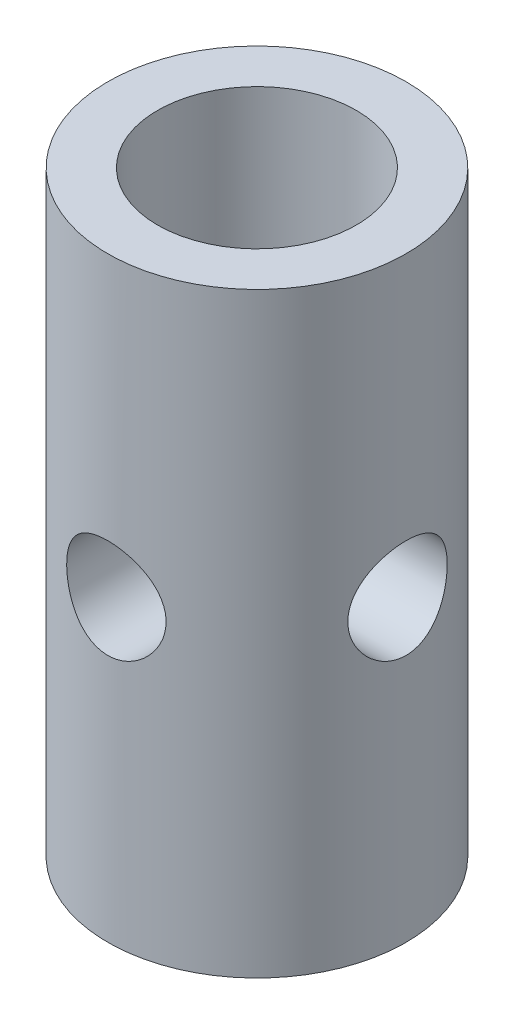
ISO-10303-21;
HEADER;
FILE_DESCRIPTION(('STEP AP214'),'2;1');
FILE_NAME('part.step','',(''),(''),'','','');
FILE_SCHEMA(('AUTOMOTIVE_DESIGN { 1 0 10303 214 1 1 1 1 }'));
ENDSEC;
DATA;
#1=APPLICATION_CONTEXT('core data for automotive mechanical design processes');
#2=APPLICATION_PROTOCOL_DEFINITION('international standard','automotive_design',2000,#1);
#3=PRODUCT_CONTEXT('',#1,'mechanical');
#4=PRODUCT('Part','Part','',(#3));
#5=PRODUCT_RELATED_PRODUCT_CATEGORY('part','',(#4));
#6=PRODUCT_DEFINITION_FORMATION('','',#4);
#7=PRODUCT_DEFINITION_CONTEXT('part definition',#1,'design');
#8=PRODUCT_DEFINITION('design','',#6,#7);
#9=PRODUCT_DEFINITION_SHAPE('','',#8);
#10=(LENGTH_UNIT() NAMED_UNIT(*) SI_UNIT(.MILLI.,.METRE.));
#11=(NAMED_UNIT(*) PLANE_ANGLE_UNIT() SI_UNIT($,.RADIAN.));
#12=(NAMED_UNIT(*) SI_UNIT($,.STERADIAN.) SOLID_ANGLE_UNIT());
#13=UNCERTAINTY_MEASURE_WITH_UNIT(LENGTH_MEASURE(1.E-05),#10,'distance_accuracy_value','');
#14=(GEOMETRIC_REPRESENTATION_CONTEXT(3) GLOBAL_UNCERTAINTY_ASSIGNED_CONTEXT((#13)) GLOBAL_UNIT_ASSIGNED_CONTEXT((#10,
#11,#12)) REPRESENTATION_CONTEXT('',''));
#15=CARTESIAN_POINT('',(0.,0.,0.));
#16=DIRECTION('',(0.,0.,1.));
#17=DIRECTION('',(1.,0.,0.));
#18=AXIS2_PLACEMENT_3D('',#15,#16,#17);
#19=CARTESIAN_POINT('',(0.,15.,-7.5));
#20=DIRECTION('',(0.,0.,1.));
#21=DIRECTION('',(1.,0.,0.));
#22=AXIS2_PLACEMENT_3D('',#19,#20,#21);
#23=CYLINDRICAL_SURFACE('',#22,2.5);
#24=CARTESIAN_POINT('',(2.5,15.,7.07106781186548));
#25=CARTESIAN_POINT('',(2.50000064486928,14.8638295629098,7.07106736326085));
#26=CARTESIAN_POINT('',(2.48883695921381,14.727663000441,7.07504423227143));
#27=CARTESIAN_POINT('',(2.44462782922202,14.4593639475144,7.09043935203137));
#28=CARTESIAN_POINT('',(2.41157878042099,14.3272321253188,7.10185882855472));
#29=CARTESIAN_POINT('',(2.32488871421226,14.0709327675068,7.13070509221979));
#30=CARTESIAN_POINT('',(2.27128805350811,13.9467501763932,7.14812009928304));
#31=CARTESIAN_POINT('',(2.14515407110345,13.7090998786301,7.18697805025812));
#32=CARTESIAN_POINT('',(2.07261657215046,13.5956345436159,7.20842188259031));
#33=CARTESIAN_POINT('',(1.90762786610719,13.3782000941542,7.25386223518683));
#34=CARTESIAN_POINT('',(1.8145608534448,13.2747114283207,7.2779223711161));
#35=CARTESIAN_POINT('',(1.61246916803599,13.0844829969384,7.32534662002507));
#36=CARTESIAN_POINT('',(1.50344193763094,12.9977459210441,7.34871062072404));
#37=CARTESIAN_POINT('',(1.26901126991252,12.841302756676,7.39284667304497));
#38=CARTESIAN_POINT('',(1.14325477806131,12.7721000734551,7.41353519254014));
#39=CARTESIAN_POINT('',(0.881078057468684,12.6560210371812,7.44923966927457));
#40=CARTESIAN_POINT('',(0.744660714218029,12.6091386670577,7.46425715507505));
#41=CARTESIAN_POINT('',(0.470072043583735,12.540660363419,7.48647688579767));
#42=CARTESIAN_POINT('',(0.332126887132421,12.5182413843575,7.49393286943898));
#43=CARTESIAN_POINT('',(0.0542446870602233,12.4967092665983,7.5010902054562));
#44=CARTESIAN_POINT('',(-0.0856918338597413,12.497590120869,7.50079355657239));
#45=CARTESIAN_POINT('',(-0.357758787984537,12.5221106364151,7.49265099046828));
#46=CARTESIAN_POINT('',(-0.489980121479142,12.5448563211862,7.48510161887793));
#47=CARTESIAN_POINT('',(-0.74860859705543,12.6109824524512,7.46367418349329));
#48=CARTESIAN_POINT('',(-0.87501534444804,12.6543642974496,7.44979569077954));
#49=CARTESIAN_POINT('',(-1.12038118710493,12.7610532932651,7.41689175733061));
#50=CARTESIAN_POINT('',(-1.23922055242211,12.8246148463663,7.39780106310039));
#51=CARTESIAN_POINT('',(-1.46481081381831,12.9696492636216,7.35645982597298));
#52=CARTESIAN_POINT('',(-1.57155833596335,13.0511271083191,7.33420840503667));
#53=CARTESIAN_POINT('',(-1.77525216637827,13.2341859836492,7.28765479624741));
#54=CARTESIAN_POINT('',(-1.87150039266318,13.3365328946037,7.26330537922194));
#55=CARTESIAN_POINT('',(-2.04569314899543,13.5561218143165,7.21618338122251));
#56=CARTESIAN_POINT('',(-2.12363485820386,13.6733661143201,7.19341104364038));
#57=CARTESIAN_POINT('',(-2.25996863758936,13.9216340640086,7.15176312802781));
#58=CARTESIAN_POINT('',(-2.31806615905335,14.0528303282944,7.1329477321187));
#59=CARTESIAN_POINT('',(-2.41110798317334,14.323928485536,7.10204127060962));
#60=CARTESIAN_POINT('',(-2.44606198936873,14.4638267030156,7.08994738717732));
#61=CARTESIAN_POINT('',(-2.4904032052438,14.7415958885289,7.07449090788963));
#62=CARTESIAN_POINT('',(-2.50087273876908,14.8792735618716,7.0707590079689));
#63=CARTESIAN_POINT('',(-2.4990135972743,15.1544403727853,7.07141680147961));
#64=CARTESIAN_POINT('',(-2.48668906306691,15.29192954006,7.07580501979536));
#65=CARTESIAN_POINT('',(-2.44056412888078,15.5578924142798,7.09184045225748));
#66=CARTESIAN_POINT('',(-2.40751598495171,15.6865135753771,7.10323313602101));
#67=CARTESIAN_POINT('',(-2.32178465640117,15.936359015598,7.13171384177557));
#68=CARTESIAN_POINT('',(-2.26909799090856,16.0575819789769,7.14880287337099));
#69=CARTESIAN_POINT('',(-2.14368585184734,16.2934510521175,7.18742193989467));
#70=CARTESIAN_POINT('',(-2.07037779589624,16.4077666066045,7.20907564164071));
#71=CARTESIAN_POINT('',(-1.90646407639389,16.6228651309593,7.25414421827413));
#72=CARTESIAN_POINT('',(-1.81585331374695,16.723644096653,7.27755961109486));
#73=CARTESIAN_POINT('',(-1.61472926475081,16.9138199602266,7.32487596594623));
#74=CARTESIAN_POINT('',(-1.50346817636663,17.0024359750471,7.34874608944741));
#75=CARTESIAN_POINT('',(-1.26706822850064,17.1597903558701,7.39317129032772));
#76=CARTESIAN_POINT('',(-1.14192986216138,17.2285294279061,7.41372648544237));
#77=CARTESIAN_POINT('',(-0.881949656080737,17.3435502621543,7.44911014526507));
#78=CARTESIAN_POINT('',(-0.74717780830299,17.3899781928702,7.46397575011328));
#79=CARTESIAN_POINT('',(-0.47114616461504,17.4593193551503,7.48646527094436));
#80=CARTESIAN_POINT('',(-0.329888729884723,17.4822410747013,7.49409180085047));
#81=CARTESIAN_POINT('',(-0.0520383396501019,17.5031551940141,7.50104658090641));
#82=CARTESIAN_POINT('',(0.0844618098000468,17.5022686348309,7.50074800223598));
#83=CARTESIAN_POINT('',(0.355277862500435,17.478356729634,7.49280491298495));
#84=CARTESIAN_POINT('',(0.489593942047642,17.4553331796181,7.48516099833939));
#85=CARTESIAN_POINT('',(0.750105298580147,17.3885444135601,7.46352287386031));
#86=CARTESIAN_POINT('',(0.876395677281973,17.3451144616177,7.44963145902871));
#87=CARTESIAN_POINT('',(1.11994587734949,17.2390561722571,7.41692901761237));
#88=CARTESIAN_POINT('',(1.23720406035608,17.1764243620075,7.39811710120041));
#89=CARTESIAN_POINT('',(1.46408504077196,17.031076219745,7.35664672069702));
#90=CARTESIAN_POINT('',(1.57326562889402,16.9477032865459,7.33387181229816));
#91=CARTESIAN_POINT('',(1.77645256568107,16.7643565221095,7.28732471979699));
#92=CARTESIAN_POINT('',(1.87045405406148,16.6643773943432,7.26355221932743));
#93=CARTESIAN_POINT('',(2.04435452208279,16.4459766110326,7.21658199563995));
#94=CARTESIAN_POINT('',(2.12355741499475,16.3269862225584,7.19344319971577));
#95=CARTESIAN_POINT('',(2.26078585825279,16.076663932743,7.15150483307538));
#96=CARTESIAN_POINT('',(2.31881694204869,15.9453352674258,7.13270412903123));
#97=CARTESIAN_POINT('',(2.40960957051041,15.6800954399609,7.10253335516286));
#98=CARTESIAN_POINT('',(2.4433947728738,15.5465693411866,7.09086582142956));
#99=CARTESIAN_POINT('',(2.48858580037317,15.2753598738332,7.07513458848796));
#100=CARTESIAN_POINT('',(2.49999934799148,15.1376779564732,7.07106826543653));
#101=CARTESIAN_POINT('',(2.5,15.,7.07106781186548));
#102=B_SPLINE_CURVE_WITH_KNOTS('',3,(#24,#25,#26,#27,#28,#29,#30,#31,#32,#33,#34,#35,#36,#37,
#38,#39,#40,#41,#42,#43,#44,#45,#46,#47,#48,#49,#50,#51,#52,#53,#54,#55,#56,#57,#58,#59,#60,#61,
#62,#63,#64,#65,#66,#67,#68,#69,#70,#71,#72,#73,#74,#75,#76,#77,#78,#79,#80,#81,#82,#83,#84,#85,
#86,#87,#88,#89,#90,#91,#92,#93,#94,#95,#96,#97,#98,#99,#100,#101),.UNSPECIFIED.,.T.,.F.,(4,2,2,
2,2,2,2,2,2,2,2,2,2,2,2,2,2,2,2,2,2,2,2,2,2,2,2,2,2,2,2,2,2,2,2,2,2,2,4),(0.,0.408001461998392,
0.816070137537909,1.22334156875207,1.63070291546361,2.0525334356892,2.4744316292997,
2.90733765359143,3.34012690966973,3.75785796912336,4.17548133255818,4.57672512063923,
4.97799610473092,5.38454137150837,5.79119979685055,6.21700435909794,6.64287449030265,
7.07481599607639,7.50657628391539,7.91885728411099,8.33106339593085,8.7291098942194,
9.12722697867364,9.53797144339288,9.94883714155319,10.3794702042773,10.8100879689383,
11.2378447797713,11.6654470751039,12.0729521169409,12.4804241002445,12.8814239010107,
13.2824962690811,13.6983879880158,14.1144126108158,14.5467225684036,14.9789194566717,
15.3915803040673,15.8040986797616),.UNSPECIFIED.);
#103=CARTESIAN_POINT('',(2.5,15.,7.07106781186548));
#104=VERTEX_POINT('',#103);
#105=EDGE_CURVE('E139',#104,#104,#102,.T.);
#106=ORIENTED_EDGE('',*,*,#105,.F.);
#107=EDGE_LOOP('',(#106));
#108=FACE_BOUND('',#107,.T.);
#109=CARTESIAN_POINT('',(0.,15.,0.));
#110=DIRECTION('',(0.707106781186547,0.,0.707106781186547));
#111=DIRECTION('',(-0.707106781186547,0.,0.707106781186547));
#112=AXIS2_PLACEMENT_3D('',#109,#110,#111);
#113=ELLIPSE('',#112,3.53553390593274,2.5);
#114=CARTESIAN_POINT('',(-1.76776695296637,13.2322330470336,1.76776695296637));
#115=VERTEX_POINT('',#114);
#116=CARTESIAN_POINT('',(-1.76776695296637,16.7677669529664,1.76776695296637));
#117=VERTEX_POINT('',#116);
#118=EDGE_CURVE('E76',#115,#117,#113,.F.);
#119=ORIENTED_EDGE('',*,*,#118,.T.);
#120=CARTESIAN_POINT('',(0.,15.,0.));
#121=DIRECTION('',(0.,-0.707106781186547,0.707106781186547));
#122=DIRECTION('',(0.,0.707106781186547,0.707106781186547));
#123=AXIS2_PLACEMENT_3D('',#120,#121,#122);
#124=ELLIPSE('',#123,3.53553390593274,2.5);
#125=CARTESIAN_POINT('',(1.76776695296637,16.7677669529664,1.76776695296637));
#126=VERTEX_POINT('',#125);
#127=EDGE_CURVE('E46',#117,#126,#124,.F.);
#128=ORIENTED_EDGE('',*,*,#127,.T.);
#129=CARTESIAN_POINT('',(0.,15.,0.));
#130=DIRECTION('',(-0.707106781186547,0.,0.707106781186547));
#131=DIRECTION('',(0.707106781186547,0.,0.707106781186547));
#132=AXIS2_PLACEMENT_3D('',#129,#130,#131);
#133=ELLIPSE('',#132,3.53553390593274,2.5);
#134=CARTESIAN_POINT('',(1.76776695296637,13.2322330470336,1.76776695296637));
#135=VERTEX_POINT('',#134);
#136=EDGE_CURVE('E89',#126,#135,#133,.F.);
#137=ORIENTED_EDGE('',*,*,#136,.T.);
#138=CARTESIAN_POINT('',(0.,15.,0.));
#139=DIRECTION('',(0.,0.707106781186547,0.707106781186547));
#140=DIRECTION('',(0.,-0.707106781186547,0.707106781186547));
#141=AXIS2_PLACEMENT_3D('',#138,#139,#140);
#142=ELLIPSE('',#141,3.53553390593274,2.5);
#143=EDGE_CURVE('E100',#135,#115,#142,.F.);
#144=ORIENTED_EDGE('',*,*,#143,.T.);
#145=EDGE_LOOP('',(#119,#128,#137,#144));
#146=FACE_BOUND('',#145,.T.);
#147=ADVANCED_FACE('F31',(#108,#146),#23,.F.);
#148=CARTESIAN_POINT('',(0.,30.,0.));
#149=DIRECTION('',(0.,-1.,0.));
#150=DIRECTION('',(0.,0.,-1.));
#151=AXIS2_PLACEMENT_3D('',#148,#149,#150);
#152=PLANE('',#151);
#153=CARTESIAN_POINT('',(0.,30.,0.));
#154=DIRECTION('',(0.,1.,0.));
#155=DIRECTION('',(0.,0.,1.));
#156=AXIS2_PLACEMENT_3D('',#153,#154,#155);
#157=CIRCLE('',#156,5.);
#158=CARTESIAN_POINT('',(0.,30.,5.));
#159=VERTEX_POINT('',#158);
#160=EDGE_CURVE('E160',#159,#159,#157,.T.);
#161=ORIENTED_EDGE('',*,*,#160,.F.);
#162=EDGE_LOOP('',(#161));
#163=FACE_BOUND('',#162,.T.);
#164=CARTESIAN_POINT('',(0.,30.,0.));
#165=DIRECTION('',(0.,-1.,0.));
#166=DIRECTION('',(0.,0.,-1.));
#167=AXIS2_PLACEMENT_3D('',#164,#165,#166);
#168=CIRCLE('',#167,7.5);
#169=CARTESIAN_POINT('',(0.,30.,-7.5));
#170=VERTEX_POINT('',#169);
#171=EDGE_CURVE('E149',#170,#170,#168,.T.);
#172=ORIENTED_EDGE('',*,*,#171,.F.);
#173=EDGE_LOOP('',(#172));
#174=FACE_BOUND('',#173,.T.);
#175=ADVANCED_FACE('F33',(#163,#174),#152,.F.);
#176=CARTESIAN_POINT('',(0.,-11.8223429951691,0.));
#177=DIRECTION('',(0.,-1.,0.));
#178=DIRECTION('',(0.,0.,-1.));
#179=AXIS2_PLACEMENT_3D('',#176,#177,#178);
#180=CYLINDRICAL_SURFACE('',#179,7.5);
#181=CARTESIAN_POINT('',(-7.5,12.5,0.));
#182=CARTESIAN_POINT('',(-7.5000003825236,12.4999993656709,-0.136408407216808));
#183=CARTESIAN_POINT('',(-7.49624423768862,12.511200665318,-0.272812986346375));
#184=CARTESIAN_POINT('',(-7.48163025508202,12.555572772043,-0.54160440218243));
#185=CARTESIAN_POINT('',(-7.47077168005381,12.5887458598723,-0.673990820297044));
#186=CARTESIAN_POINT('',(-7.44313269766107,12.6757981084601,-0.93083197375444));
#187=CARTESIAN_POINT('',(-7.42636219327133,12.7296426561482,-1.05529956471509));
#188=CARTESIAN_POINT('',(-7.38861114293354,12.8563529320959,-1.29343734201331));
#189=CARTESIAN_POINT('',(-7.36762976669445,12.9292224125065,-1.40710539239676));
#190=CARTESIAN_POINT('',(-7.32285236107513,13.0945645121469,-1.62435418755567));
#191=CARTESIAN_POINT('',(-7.29898891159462,13.1875780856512,-1.72750925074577));
#192=CARTESIAN_POINT('',(-7.25150786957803,13.3894178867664,-1.91708173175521));
#193=CARTESIAN_POINT('',(-7.22789033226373,13.4982475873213,-2.00349546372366));
#194=CARTESIAN_POINT('',(-7.18283331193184,13.7324627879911,-2.15956235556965));
#195=CARTESIAN_POINT('',(-7.1614759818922,13.8582343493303,-2.22866214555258));
#196=CARTESIAN_POINT('',(-7.12438263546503,14.1204402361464,-2.3445471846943));
#197=CARTESIAN_POINT('',(-7.10864490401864,14.2568712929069,-2.39133924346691));
#198=CARTESIAN_POINT('',(-7.08528258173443,14.5316830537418,-2.45968365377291));
#199=CARTESIAN_POINT('',(-7.07740239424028,14.6698430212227,-2.48203362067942));
#200=CARTESIAN_POINT('',(-7.06989141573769,14.9481593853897,-2.50335280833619));
#201=CARTESIAN_POINT('',(-7.07025807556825,15.088315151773,-2.5023292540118));
#202=CARTESIAN_POINT('',(-7.0789753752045,15.35984157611,-2.47754975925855));
#203=CARTESIAN_POINT('',(-7.08696039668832,15.4913210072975,-2.45483478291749));
#204=CARTESIAN_POINT('',(-7.10941644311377,15.7484835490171,-2.38901540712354));
#205=CARTESIAN_POINT('',(-7.12388824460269,15.8741659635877,-2.34590856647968));
#206=CARTESIAN_POINT('',(-7.15794777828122,16.1185318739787,-2.23984764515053));
#207=CARTESIAN_POINT('',(-7.17761414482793,16.2370700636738,-2.17658512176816));
#208=CARTESIAN_POINT('',(-7.21981396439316,16.4621772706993,-2.03222276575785));
#209=CARTESIAN_POINT('',(-7.24234824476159,16.5687428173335,-1.95111778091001));
#210=CARTESIAN_POINT('',(-7.28918322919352,16.7727289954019,-1.76837333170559));
#211=CARTESIAN_POINT('',(-7.31351473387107,16.8693817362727,-1.66588287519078));
#212=CARTESIAN_POINT('',(-7.36017345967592,17.0443281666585,-1.44584892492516));
#213=CARTESIAN_POINT('',(-7.38250048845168,17.1226200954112,-1.32830398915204));
#214=CARTESIAN_POINT('',(-7.42292769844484,17.2592407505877,-1.07986903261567));
#215=CARTESIAN_POINT('',(-7.44098375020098,17.3173637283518,-0.948858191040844));
#216=CARTESIAN_POINT('',(-7.47051417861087,17.4105079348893,-0.67817270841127));
#217=CARTESIAN_POINT('',(-7.48199084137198,17.4455371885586,-0.538501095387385));
#218=CARTESIAN_POINT('',(-7.49669067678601,17.4901391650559,-0.26095957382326));
#219=CARTESIAN_POINT('',(-7.5002500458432,17.5007495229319,-0.123273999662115));
#220=CARTESIAN_POINT('',(-7.49972256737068,17.4991683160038,0.151937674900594));
#221=CARTESIAN_POINT('',(-7.49563701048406,17.4869806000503,0.289463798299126));
#222=CARTESIAN_POINT('',(-7.48050061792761,17.4409702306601,0.556299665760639));
#223=CARTESIAN_POINT('',(-7.46965496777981,17.4077844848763,0.685732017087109));
#224=CARTESIAN_POINT('',(-7.44229617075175,17.3215163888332,0.937139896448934));
#225=CARTESIAN_POINT('',(-7.42578230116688,17.2684315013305,1.05911447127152));
#226=CARTESIAN_POINT('',(-7.38822328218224,17.142323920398,1.29572074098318));
#227=CARTESIAN_POINT('',(-7.36707036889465,17.0688135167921,1.41007489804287));
#228=CARTESIAN_POINT('',(-7.32263134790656,16.9045146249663,1.62516207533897));
#229=CARTESIAN_POINT('',(-7.29934458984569,16.8137208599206,1.72589091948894));
#230=CARTESIAN_POINT('',(-7.25192119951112,16.6125531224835,1.91563126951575));
#231=CARTESIAN_POINT('',(-7.2277940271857,16.5014769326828,2.00390242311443));
#232=CARTESIAN_POINT('',(-7.18249933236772,16.2655710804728,2.16064380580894));
#233=CARTESIAN_POINT('',(-7.16133183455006,16.1407413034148,2.22911386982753));
#234=CARTESIAN_POINT('',(-7.12455979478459,15.8808174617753,2.3439923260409));
#235=CARTESIAN_POINT('',(-7.10894401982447,15.7457448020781,2.39044533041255));
#236=CARTESIAN_POINT('',(-7.08527080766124,15.4690533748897,2.45973666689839));
#237=CARTESIAN_POINT('',(-7.07720996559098,15.3274375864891,2.48258563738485));
#238=CARTESIAN_POINT('',(-7.06994647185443,15.0495072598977,2.50319070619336));
#239=CARTESIAN_POINT('',(-7.07031000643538,14.9132941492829,2.502175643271));
#240=CARTESIAN_POINT('',(-7.07878174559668,14.6430873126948,2.47810573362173));
#241=CARTESIAN_POINT('',(-7.08688948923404,14.5090934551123,2.45505219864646));
#242=CARTESIAN_POINT('',(-7.10961310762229,14.2496608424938,2.38842953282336));
#243=CARTESIAN_POINT('',(-7.12410245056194,14.1241079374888,2.34525836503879));
#244=CARTESIAN_POINT('',(-7.15790997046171,13.8819314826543,2.23994841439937));
#245=CARTESIAN_POINT('',(-7.17722921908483,13.76530992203,2.17780542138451));
#246=CARTESIAN_POINT('',(-7.21957073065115,13.5387908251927,2.03315173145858));
#247=CARTESIAN_POINT('',(-7.24271779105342,13.429408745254,1.94987060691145));
#248=CARTESIAN_POINT('',(-7.28958390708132,13.2257754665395,1.76660720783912));
#249=CARTESIAN_POINT('',(-7.31330312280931,13.1315285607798,1.66662021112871));
#250=CARTESIAN_POINT('',(-7.3597507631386,12.9571389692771,1.44810389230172));
#251=CARTESIAN_POINT('',(-7.38240454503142,12.8776891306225,1.32900378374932));
#252=CARTESIAN_POINT('',(-7.4231497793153,12.7400239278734,1.07839339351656));
#253=CARTESIAN_POINT('',(-7.44124239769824,12.6818031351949,0.946886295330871));
#254=CARTESIAN_POINT('',(-7.47013787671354,12.5906959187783,0.68123411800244));
#255=CARTESIAN_POINT('',(-7.48123031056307,12.5567938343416,0.547469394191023));
#256=CARTESIAN_POINT('',(-7.49616017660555,12.5114492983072,0.275801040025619));
#257=CARTESIAN_POINT('',(-7.49999961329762,12.5000006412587,0.137898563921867));
#258=CARTESIAN_POINT('',(-7.5,12.5,0.));
#259=B_SPLINE_CURVE_WITH_KNOTS('',3,(#181,#182,#183,#184,#185,#186,#187,#188,#189,#190,#191,
#192,#193,#194,#195,#196,#197,#198,#199,#200,#201,#202,#203,#204,#205,#206,#207,#208,#209,#210,
#211,#212,#213,#214,#215,#216,#217,#218,#219,#220,#221,#222,#223,#224,#225,#226,#227,#228,#229,
#230,#231,#232,#233,#234,#235,#236,#237,#238,#239,#240,#241,#242,#243,#244,#245,#246,#247,#248,
#249,#250,#251,#252,#253,#254,#255,#256,#257,#258),.UNSPECIFIED.,.T.,.F.,(4,2,2,2,2,2,2,2,2,2,2,
2,2,2,2,2,2,2,2,2,2,2,2,2,2,2,2,2,2,2,2,2,2,2,2,2,2,2,4),(0.,0.408717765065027,
0.817477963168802,1.22555668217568,1.63371594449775,2.0546171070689,2.47561083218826,
2.90870962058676,3.34167611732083,3.760048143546,4.17829084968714,4.577420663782,
4.97659827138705,5.38220427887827,5.78792756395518,6.21483264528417,6.64177864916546,
7.07296014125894,7.50399172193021,7.91633957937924,8.32861782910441,8.72895394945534,
9.1293411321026,9.54025999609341,9.95130452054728,10.3810255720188,10.8107502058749,
11.2396003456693,11.668257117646,12.0748916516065,12.4815019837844,12.8803896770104,
13.2793659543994,13.6957516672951,14.1122552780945,14.5449915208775,14.9776170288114,
15.3909139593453,15.8040966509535),.UNSPECIFIED.);
#260=CARTESIAN_POINT('',(-7.5,12.5,0.));
#261=VERTEX_POINT('',#260);
#262=EDGE_CURVE('E118',#261,#261,#259,.T.);
#263=ORIENTED_EDGE('',*,*,#262,.T.);
#264=EDGE_LOOP('',(#263));
#265=FACE_BOUND('',#264,.T.);
#266=CARTESIAN_POINT('',(7.07106781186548,15.,-2.5));
#267=CARTESIAN_POINT('',(7.07106736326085,14.8638295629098,-2.50000064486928));
#268=CARTESIAN_POINT('',(7.07504423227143,14.727663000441,-2.48883695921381));
#269=CARTESIAN_POINT('',(7.09043935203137,14.4593639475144,-2.44462782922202));
#270=CARTESIAN_POINT('',(7.10185882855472,14.3272321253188,-2.41157878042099));
#271=CARTESIAN_POINT('',(7.13070509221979,14.0709327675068,-2.32488871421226));
#272=CARTESIAN_POINT('',(7.14812009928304,13.9467501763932,-2.27128805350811));
#273=CARTESIAN_POINT('',(7.18697805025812,13.7090998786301,-2.14515407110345));
#274=CARTESIAN_POINT('',(7.20842188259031,13.5956345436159,-2.07261657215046));
#275=CARTESIAN_POINT('',(7.25386223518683,13.3782000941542,-1.90762786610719));
#276=CARTESIAN_POINT('',(7.2779223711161,13.2747114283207,-1.8145608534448));
#277=CARTESIAN_POINT('',(7.32534662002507,13.0844829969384,-1.61246916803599));
#278=CARTESIAN_POINT('',(7.34871062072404,12.9977459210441,-1.50344193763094));
#279=CARTESIAN_POINT('',(7.39284667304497,12.841302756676,-1.26901126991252));
#280=CARTESIAN_POINT('',(7.41353519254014,12.7721000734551,-1.14325477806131));
#281=CARTESIAN_POINT('',(7.44923966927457,12.6560210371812,-0.881078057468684));
#282=CARTESIAN_POINT('',(7.46425715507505,12.6091386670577,-0.744660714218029));
#283=CARTESIAN_POINT('',(7.48647688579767,12.540660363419,-0.470072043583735));
#284=CARTESIAN_POINT('',(7.49393286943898,12.5182413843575,-0.332126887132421));
#285=CARTESIAN_POINT('',(7.5010902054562,12.4967092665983,-0.0542446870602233));
#286=CARTESIAN_POINT('',(7.50079355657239,12.497590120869,0.0856918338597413));
#287=CARTESIAN_POINT('',(7.49265099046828,12.5221106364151,0.357758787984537));
#288=CARTESIAN_POINT('',(7.48510161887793,12.5448563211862,0.489980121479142));
#289=CARTESIAN_POINT('',(7.46367418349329,12.6109824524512,0.74860859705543));
#290=CARTESIAN_POINT('',(7.44979569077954,12.6543642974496,0.87501534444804));
#291=CARTESIAN_POINT('',(7.41689175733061,12.7610532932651,1.12038118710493));
#292=CARTESIAN_POINT('',(7.39780106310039,12.8246148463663,1.23922055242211));
#293=CARTESIAN_POINT('',(7.35645982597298,12.9696492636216,1.46481081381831));
#294=CARTESIAN_POINT('',(7.33420840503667,13.0511271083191,1.57155833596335));
#295=CARTESIAN_POINT('',(7.28765479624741,13.2341859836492,1.77525216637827));
#296=CARTESIAN_POINT('',(7.26330537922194,13.3365328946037,1.87150039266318));
#297=CARTESIAN_POINT('',(7.21618338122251,13.5561218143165,2.04569314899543));
#298=CARTESIAN_POINT('',(7.19341104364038,13.6733661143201,2.12363485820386));
#299=CARTESIAN_POINT('',(7.15176312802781,13.9216340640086,2.25996863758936));
#300=CARTESIAN_POINT('',(7.1329477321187,14.0528303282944,2.31806615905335));
#301=CARTESIAN_POINT('',(7.10204127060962,14.323928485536,2.41110798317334));
#302=CARTESIAN_POINT('',(7.08994738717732,14.4638267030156,2.44606198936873));
#303=CARTESIAN_POINT('',(7.07449090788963,14.7415958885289,2.4904032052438));
#304=CARTESIAN_POINT('',(7.0707590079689,14.8792735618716,2.50087273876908));
#305=CARTESIAN_POINT('',(7.07141680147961,15.1544403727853,2.4990135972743));
#306=CARTESIAN_POINT('',(7.07580501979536,15.29192954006,2.48668906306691));
#307=CARTESIAN_POINT('',(7.09184045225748,15.5578924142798,2.44056412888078));
#308=CARTESIAN_POINT('',(7.10323313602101,15.6865135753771,2.40751598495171));
#309=CARTESIAN_POINT('',(7.13171384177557,15.936359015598,2.32178465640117));
#310=CARTESIAN_POINT('',(7.14880287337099,16.0575819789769,2.26909799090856));
#311=CARTESIAN_POINT('',(7.18742193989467,16.2934510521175,2.14368585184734));
#312=CARTESIAN_POINT('',(7.20907564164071,16.4077666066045,2.07037779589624));
#313=CARTESIAN_POINT('',(7.25414421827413,16.6228651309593,1.90646407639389));
#314=CARTESIAN_POINT('',(7.27755961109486,16.723644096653,1.81585331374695));
#315=CARTESIAN_POINT('',(7.32487596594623,16.9138199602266,1.61472926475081));
#316=CARTESIAN_POINT('',(7.34874608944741,17.0024359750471,1.50346817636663));
#317=CARTESIAN_POINT('',(7.39317129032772,17.1597903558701,1.26706822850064));
#318=CARTESIAN_POINT('',(7.41372648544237,17.2285294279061,1.14192986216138));
#319=CARTESIAN_POINT('',(7.44911014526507,17.3435502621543,0.881949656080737));
#320=CARTESIAN_POINT('',(7.46397575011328,17.3899781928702,0.74717780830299));
#321=CARTESIAN_POINT('',(7.48646527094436,17.4593193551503,0.47114616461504));
#322=CARTESIAN_POINT('',(7.49409180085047,17.4822410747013,0.329888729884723));
#323=CARTESIAN_POINT('',(7.50104658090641,17.5031551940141,0.0520383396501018));
#324=CARTESIAN_POINT('',(7.50074800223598,17.5022686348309,-0.0844618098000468));
#325=CARTESIAN_POINT('',(7.49280491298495,17.478356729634,-0.355277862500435));
#326=CARTESIAN_POINT('',(7.48516099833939,17.4553331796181,-0.489593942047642));
#327=CARTESIAN_POINT('',(7.46352287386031,17.3885444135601,-0.750105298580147));
#328=CARTESIAN_POINT('',(7.44963145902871,17.3451144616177,-0.876395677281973));
#329=CARTESIAN_POINT('',(7.41692901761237,17.2390561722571,-1.11994587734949));
#330=CARTESIAN_POINT('',(7.39811710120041,17.1764243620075,-1.23720406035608));
#331=CARTESIAN_POINT('',(7.35664672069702,17.031076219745,-1.46408504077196));
#332=CARTESIAN_POINT('',(7.33387181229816,16.9477032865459,-1.57326562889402));
#333=CARTESIAN_POINT('',(7.28732471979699,16.7643565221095,-1.77645256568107));
#334=CARTESIAN_POINT('',(7.26355221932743,16.6643773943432,-1.87045405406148));
#335=CARTESIAN_POINT('',(7.21658199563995,16.4459766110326,-2.0443545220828));
#336=CARTESIAN_POINT('',(7.19344319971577,16.3269862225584,-2.12355741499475));
#337=CARTESIAN_POINT('',(7.15150483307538,16.0766639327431,-2.26078585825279));
#338=CARTESIAN_POINT('',(7.13270412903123,15.9453352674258,-2.31881694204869));
#339=CARTESIAN_POINT('',(7.10253335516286,15.6800954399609,-2.40960957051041));
#340=CARTESIAN_POINT('',(7.09086582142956,15.5465693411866,-2.4433947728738));
#341=CARTESIAN_POINT('',(7.07513458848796,15.2753598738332,-2.48858580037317));
#342=CARTESIAN_POINT('',(7.07106826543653,15.1376779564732,-2.49999934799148));
#343=CARTESIAN_POINT('',(7.07106781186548,15.,-2.5));
#344=B_SPLINE_CURVE_WITH_KNOTS('',3,(#266,#267,#268,#269,#270,#271,#272,#273,#274,#275,#276,
#277,#278,#279,#280,#281,#282,#283,#284,#285,#286,#287,#288,#289,#290,#291,#292,#293,#294,#295,
#296,#297,#298,#299,#300,#301,#302,#303,#304,#305,#306,#307,#308,#309,#310,#311,#312,#313,#314,
#315,#316,#317,#318,#319,#320,#321,#322,#323,#324,#325,#326,#327,#328,#329,#330,#331,#332,#333,
#334,#335,#336,#337,#338,#339,#340,#341,#342,#343),.UNSPECIFIED.,.T.,.F.,(4,2,2,2,2,2,2,2,2,2,2,
2,2,2,2,2,2,2,2,2,2,2,2,2,2,2,2,2,2,2,2,2,2,2,2,2,2,2,4),(0.,0.408001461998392,
0.816070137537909,1.22334156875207,1.63070291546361,2.0525334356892,2.4744316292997,
2.90733765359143,3.34012690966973,3.75785796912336,4.17548133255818,4.57672512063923,
4.97799610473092,5.38454137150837,5.79119979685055,6.21700435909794,6.64287449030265,
7.07481599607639,7.50657628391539,7.91885728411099,8.33106339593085,8.7291098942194,
9.12722697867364,9.53797144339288,9.94883714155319,10.3794702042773,10.8100879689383,
11.2378447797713,11.6654470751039,12.0729521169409,12.4804241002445,12.8814239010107,
13.2824962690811,13.6983879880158,14.1144126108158,14.5467225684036,14.9789194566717,
15.3915803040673,15.8040986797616),.UNSPECIFIED.);
#345=CARTESIAN_POINT('',(7.07106781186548,15.,-2.5));
#346=VERTEX_POINT('',#345);
#347=EDGE_CURVE('E112',#346,#346,#344,.T.);
#348=ORIENTED_EDGE('',*,*,#347,.T.);
#349=EDGE_LOOP('',(#348));
#350=FACE_BOUND('',#349,.T.);
#351=CARTESIAN_POINT('',(0.,17.5,-7.5));
#352=CARTESIAN_POINT('',(-0.136408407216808,17.5000006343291,-7.5000003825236));
#353=CARTESIAN_POINT('',(-0.272812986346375,17.488799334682,-7.49624423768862));
#354=CARTESIAN_POINT('',(-0.541604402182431,17.444427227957,-7.48163025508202));
#355=CARTESIAN_POINT('',(-0.673990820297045,17.4112541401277,-7.47077168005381));
#356=CARTESIAN_POINT('',(-0.930831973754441,17.3242018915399,-7.44313269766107));
#357=CARTESIAN_POINT('',(-1.05529956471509,17.2703573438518,-7.42636219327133));
#358=CARTESIAN_POINT('',(-1.29343734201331,17.1436470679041,-7.38861114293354));
#359=CARTESIAN_POINT('',(-1.40710539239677,17.0707775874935,-7.36762976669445));
#360=CARTESIAN_POINT('',(-1.62435418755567,16.9054354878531,-7.32285236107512));
#361=CARTESIAN_POINT('',(-1.72750925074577,16.8124219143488,-7.29898891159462));
#362=CARTESIAN_POINT('',(-1.91708173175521,16.6105821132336,-7.25150786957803));
#363=CARTESIAN_POINT('',(-2.00349546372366,16.5017524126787,-7.22789033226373));
#364=CARTESIAN_POINT('',(-2.15956235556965,16.2675372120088,-7.18283331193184));
#365=CARTESIAN_POINT('',(-2.22866214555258,16.1417656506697,-7.1614759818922));
#366=CARTESIAN_POINT('',(-2.34454718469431,15.8795597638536,-7.12438263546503));
#367=CARTESIAN_POINT('',(-2.39133924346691,15.7431287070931,-7.10864490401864));
#368=CARTESIAN_POINT('',(-2.45968365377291,15.4683169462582,-7.08528258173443));
#369=CARTESIAN_POINT('',(-2.48203362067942,15.3301569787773,-7.07740239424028));
#370=CARTESIAN_POINT('',(-2.50335280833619,15.0518406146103,-7.06989141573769));
#371=CARTESIAN_POINT('',(-2.5023292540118,14.911684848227,-7.07025807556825));
#372=CARTESIAN_POINT('',(-2.47754975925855,14.6401584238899,-7.0789753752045));
#373=CARTESIAN_POINT('',(-2.45483478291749,14.5086789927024,-7.08696039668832));
#374=CARTESIAN_POINT('',(-2.38901540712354,14.2515164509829,-7.10941644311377));
#375=CARTESIAN_POINT('',(-2.34590856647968,14.1258340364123,-7.12388824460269));
#376=CARTESIAN_POINT('',(-2.23984764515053,13.8814681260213,-7.15794777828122));
#377=CARTESIAN_POINT('',(-2.17658512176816,13.7629299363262,-7.17761414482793));
#378=CARTESIAN_POINT('',(-2.03222276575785,13.5378227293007,-7.21981396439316));
#379=CARTESIAN_POINT('',(-1.95111778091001,13.4312571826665,-7.24234824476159));
#380=CARTESIAN_POINT('',(-1.76837333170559,13.2272710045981,-7.28918322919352));
#381=CARTESIAN_POINT('',(-1.66588287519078,13.1306182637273,-7.31351473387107));
#382=CARTESIAN_POINT('',(-1.44584892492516,12.9556718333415,-7.36017345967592));
#383=CARTESIAN_POINT('',(-1.32830398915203,12.8773799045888,-7.38250048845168));
#384=CARTESIAN_POINT('',(-1.07986903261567,12.7407592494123,-7.42292769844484));
#385=CARTESIAN_POINT('',(-0.94885819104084,12.6826362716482,-7.44098375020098));
#386=CARTESIAN_POINT('',(-0.678172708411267,12.5894920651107,-7.47051417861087));
#387=CARTESIAN_POINT('',(-0.538501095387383,12.5544628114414,-7.48199084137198));
#388=CARTESIAN_POINT('',(-0.260959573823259,12.5098608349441,-7.49669067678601));
#389=CARTESIAN_POINT('',(-0.123273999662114,12.4992504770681,-7.5002500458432));
#390=CARTESIAN_POINT('',(0.151937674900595,12.5008316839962,-7.49972256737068));
#391=CARTESIAN_POINT('',(0.289463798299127,12.5130193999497,-7.49563701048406));
#392=CARTESIAN_POINT('',(0.556299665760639,12.5590297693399,-7.48050061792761));
#393=CARTESIAN_POINT('',(0.685732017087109,12.5922155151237,-7.46965496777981));
#394=CARTESIAN_POINT('',(0.937139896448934,12.6784836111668,-7.44229617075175));
#395=CARTESIAN_POINT('',(1.05911447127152,12.7315684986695,-7.42578230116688));
#396=CARTESIAN_POINT('',(1.29572074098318,12.857676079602,-7.38822328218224));
#397=CARTESIAN_POINT('',(1.41007489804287,12.9311864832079,-7.36707036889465));
#398=CARTESIAN_POINT('',(1.62516207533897,13.0954853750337,-7.32263134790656));
#399=CARTESIAN_POINT('',(1.72589091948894,13.1862791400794,-7.29934458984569));
#400=CARTESIAN_POINT('',(1.91563126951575,13.3874468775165,-7.25192119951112));
#401=CARTESIAN_POINT('',(2.00390242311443,13.4985230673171,-7.2277940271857));
#402=CARTESIAN_POINT('',(2.16064380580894,13.7344289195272,-7.18249933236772));
#403=CARTESIAN_POINT('',(2.22911386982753,13.8592586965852,-7.16133183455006));
#404=CARTESIAN_POINT('',(2.3439923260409,14.1191825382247,-7.12455979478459));
#405=CARTESIAN_POINT('',(2.39044533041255,14.2542551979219,-7.10894401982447));
#406=CARTESIAN_POINT('',(2.45973666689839,14.5309466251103,-7.08527080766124));
#407=CARTESIAN_POINT('',(2.48258563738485,14.6725624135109,-7.07720996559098));
#408=CARTESIAN_POINT('',(2.50319070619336,14.9504927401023,-7.06994647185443));
#409=CARTESIAN_POINT('',(2.502175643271,15.0867058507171,-7.07031000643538));
#410=CARTESIAN_POINT('',(2.47810573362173,15.3569126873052,-7.07878174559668));
#411=CARTESIAN_POINT('',(2.45505219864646,15.4909065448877,-7.08688948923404));
#412=CARTESIAN_POINT('',(2.38842953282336,15.7503391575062,-7.10961310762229));
#413=CARTESIAN_POINT('',(2.34525836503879,15.8758920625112,-7.12410245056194));
#414=CARTESIAN_POINT('',(2.23994841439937,16.1180685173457,-7.15790997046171));
#415=CARTESIAN_POINT('',(2.17780542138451,16.23469007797,-7.17722921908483));
#416=CARTESIAN_POINT('',(2.03315173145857,16.4612091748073,-7.21957073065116));
#417=CARTESIAN_POINT('',(1.94987060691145,16.570591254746,-7.24271779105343));
#418=CARTESIAN_POINT('',(1.76660720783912,16.7742245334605,-7.28958390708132));
#419=CARTESIAN_POINT('',(1.6666202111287,16.8684714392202,-7.31330312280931));
#420=CARTESIAN_POINT('',(1.44810389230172,17.0428610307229,-7.3597507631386));
#421=CARTESIAN_POINT('',(1.32900378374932,17.1223108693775,-7.38240454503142));
#422=CARTESIAN_POINT('',(1.07839339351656,17.2599760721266,-7.4231497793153));
#423=CARTESIAN_POINT('',(0.946886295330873,17.3181968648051,-7.44124239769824));
#424=CARTESIAN_POINT('',(0.681234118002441,17.4093040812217,-7.47013787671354));
#425=CARTESIAN_POINT('',(0.547469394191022,17.4432061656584,-7.48123031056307));
#426=CARTESIAN_POINT('',(0.275801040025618,17.4885507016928,-7.49616017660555));
#427=CARTESIAN_POINT('',(0.137898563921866,17.4999993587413,-7.49999961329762));
#428=CARTESIAN_POINT('',(0.,17.5,-7.5));
#429=B_SPLINE_CURVE_WITH_KNOTS('',3,(#351,#352,#353,#354,#355,#356,#357,#358,#359,#360,#361,
#362,#363,#364,#365,#366,#367,#368,#369,#370,#371,#372,#373,#374,#375,#376,#377,#378,#379,#380,
#381,#382,#383,#384,#385,#386,#387,#388,#389,#390,#391,#392,#393,#394,#395,#396,#397,#398,#399,
#400,#401,#402,#403,#404,#405,#406,#407,#408,#409,#410,#411,#412,#413,#414,#415,#416,#417,#418,
#419,#420,#421,#422,#423,#424,#425,#426,#427,#428),.UNSPECIFIED.,.T.,.F.,(4,2,2,2,2,2,2,2,2,2,2,
2,2,2,2,2,2,2,2,2,2,2,2,2,2,2,2,2,2,2,2,2,2,2,2,2,2,2,4),(0.,0.408717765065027,
0.817477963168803,1.22555668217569,1.63371594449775,2.0546171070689,2.47561083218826,
2.90870962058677,3.34167611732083,3.760048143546,4.17829084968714,4.57742066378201,
4.97659827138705,5.38220427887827,5.78792756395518,6.21483264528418,6.64177864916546,
7.07296014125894,7.50399172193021,7.91633957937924,8.32861782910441,8.72895394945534,
9.1293411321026,9.54025999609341,9.95130452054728,10.3810255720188,10.8107502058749,
11.2396003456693,11.668257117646,12.0748916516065,12.4815019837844,12.8803896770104,
13.2793659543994,13.6957516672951,14.1122552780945,14.5449915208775,14.9776170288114,
15.3909139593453,15.8040966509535),.UNSPECIFIED.);
#430=CARTESIAN_POINT('',(0.,17.5,-7.5));
#431=VERTEX_POINT('',#430);
#432=EDGE_CURVE('E93',#431,#431,#429,.T.);
#433=ORIENTED_EDGE('',*,*,#432,.T.);
#434=EDGE_LOOP('',(#433));
#435=FACE_BOUND('',#434,.T.);
#436=ORIENTED_EDGE('',*,*,#105,.T.);
#437=EDGE_LOOP('',(#436));
#438=FACE_BOUND('',#437,.T.);
#439=CARTESIAN_POINT('',(0.,0.,0.));
#440=DIRECTION('',(0.,-1.,0.));
#441=DIRECTION('',(0.,0.,-1.));
#442=AXIS2_PLACEMENT_3D('',#439,#440,#441);
#443=CIRCLE('',#442,7.5);
#444=CARTESIAN_POINT('',(0.,0.,-7.5));
#445=VERTEX_POINT('',#444);
#446=EDGE_CURVE('E153',#445,#445,#443,.T.);
#447=ORIENTED_EDGE('',*,*,#446,.F.);
#448=EDGE_LOOP('',(#447));
#449=FACE_BOUND('',#448,.T.);
#450=ORIENTED_EDGE('',*,*,#171,.T.);
#451=EDGE_LOOP('',(#450));
#452=FACE_BOUND('',#451,.T.);
#453=ADVANCED_FACE('F122',(#265,#350,#435,#438,#449,#452),#180,.T.);
#454=CARTESIAN_POINT('',(0.,0.,0.));
#455=DIRECTION('',(0.,1.,0.));
#456=DIRECTION('',(0.,0.,1.));
#457=AXIS2_PLACEMENT_3D('',#454,#455,#456);
#458=PLANE('',#457);
#459=CARTESIAN_POINT('',(0.,0.,0.));
#460=DIRECTION('',(0.,-1.,0.));
#461=DIRECTION('',(0.,0.,-1.));
#462=AXIS2_PLACEMENT_3D('',#459,#460,#461);
#463=CIRCLE('',#462,2.5);
#464=CARTESIAN_POINT('',(0.,0.,-2.5));
#465=VERTEX_POINT('',#464);
#466=EDGE_CURVE('E85',#465,#465,#463,.T.);
#467=ORIENTED_EDGE('',*,*,#466,.F.);
#468=EDGE_LOOP('',(#467));
#469=FACE_BOUND('',#468,.T.);
#470=ORIENTED_EDGE('',*,*,#446,.T.);
#471=EDGE_LOOP('',(#470));
#472=FACE_BOUND('',#471,.T.);
#473=ADVANCED_FACE('F169',(#469,#472),#458,.F.);
#474=CARTESIAN_POINT('',(0.,18.,0.));
#475=DIRECTION('',(0.,1.,0.));
#476=DIRECTION('',(0.,0.,1.));
#477=AXIS2_PLACEMENT_3D('',#474,#475,#476);
#478=CYLINDRICAL_SURFACE('',#477,5.);
#479=CARTESIAN_POINT('',(0.,18.,0.));
#480=DIRECTION('',(0.,1.,0.));
#481=DIRECTION('',(0.,0.,1.));
#482=AXIS2_PLACEMENT_3D('',#479,#480,#481);
#483=CIRCLE('',#482,5.);
#484=CARTESIAN_POINT('',(0.,18.,5.));
#485=VERTEX_POINT('',#484);
#486=EDGE_CURVE('E157',#485,#485,#483,.T.);
#487=ORIENTED_EDGE('',*,*,#486,.F.);
#488=EDGE_LOOP('',(#487));
#489=FACE_BOUND('',#488,.T.);
#490=ORIENTED_EDGE('',*,*,#160,.T.);
#491=EDGE_LOOP('',(#490));
#492=FACE_BOUND('',#491,.T.);
#493=ADVANCED_FACE('F166',(#489,#492),#478,.F.);
#494=CARTESIAN_POINT('',(0.,18.,0.));
#495=DIRECTION('',(0.,1.,0.));
#496=DIRECTION('',(0.,0.,1.));
#497=AXIS2_PLACEMENT_3D('',#494,#495,#496);
#498=PLANE('',#497);
#499=CARTESIAN_POINT('',(0.,18.,0.));
#500=DIRECTION('',(0.,1.,0.));
#501=DIRECTION('',(0.,0.,1.));
#502=AXIS2_PLACEMENT_3D('',#499,#500,#501);
#503=CIRCLE('',#502,2.5);
#504=CARTESIAN_POINT('',(0.,18.,2.5));
#505=VERTEX_POINT('',#504);
#506=EDGE_CURVE('E104',#505,#505,#503,.T.);
#507=ORIENTED_EDGE('',*,*,#506,.F.);
#508=EDGE_LOOP('',(#507));
#509=FACE_BOUND('',#508,.T.);
#510=ORIENTED_EDGE('',*,*,#486,.T.);
#511=EDGE_LOOP('',(#510));
#512=FACE_BOUND('',#511,.T.);
#513=ADVANCED_FACE('F135',(#509,#512),#498,.T.);
#514=CARTESIAN_POINT('',(0.,15.,0.));
#515=DIRECTION('',(-0.707106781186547,0.,0.707106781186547));
#516=DIRECTION('',(0.707106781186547,0.,0.707106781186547));
#517=AXIS2_PLACEMENT_3D('',#514,#515,#516);
#518=ELLIPSE('',#517,3.53553390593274,2.5);
#519=CARTESIAN_POINT('',(-1.76776695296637,16.7677669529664,-1.76776695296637));
#520=VERTEX_POINT('',#519);
#521=CARTESIAN_POINT('',(-1.76776695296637,13.2322330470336,-1.76776695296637));
#522=VERTEX_POINT('',#521);
#523=EDGE_CURVE('E82',#520,#522,#518,.T.);
#524=ORIENTED_EDGE('',*,*,#523,.T.);
#525=CARTESIAN_POINT('',(0.,15.,0.));
#526=DIRECTION('',(0.,-0.707106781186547,0.707106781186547));
#527=DIRECTION('',(0.,0.707106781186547,0.707106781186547));
#528=AXIS2_PLACEMENT_3D('',#525,#526,#527);
#529=ELLIPSE('',#528,3.53553390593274,2.5);
#530=CARTESIAN_POINT('',(1.76776695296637,13.2322330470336,-1.76776695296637));
#531=VERTEX_POINT('',#530);
#532=EDGE_CURVE('E54',#522,#531,#529,.T.);
#533=ORIENTED_EDGE('',*,*,#532,.T.);
#534=CARTESIAN_POINT('',(0.,15.,0.));
#535=DIRECTION('',(0.707106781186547,0.,0.707106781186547));
#536=DIRECTION('',(-0.707106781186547,0.,0.707106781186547));
#537=AXIS2_PLACEMENT_3D('',#534,#535,#536);
#538=ELLIPSE('',#537,3.53553390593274,2.5);
#539=CARTESIAN_POINT('',(1.76776695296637,16.7677669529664,-1.76776695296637));
#540=VERTEX_POINT('',#539);
#541=EDGE_CURVE('E84',#531,#540,#538,.T.);
#542=ORIENTED_EDGE('',*,*,#541,.T.);
#543=CARTESIAN_POINT('',(0.,15.,0.));
#544=DIRECTION('',(0.,0.707106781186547,0.707106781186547));
#545=DIRECTION('',(0.,-0.707106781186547,0.707106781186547));
#546=AXIS2_PLACEMENT_3D('',#543,#544,#545);
#547=ELLIPSE('',#546,3.53553390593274,2.5);
#548=EDGE_CURVE('E70',#540,#520,#547,.T.);
#549=ORIENTED_EDGE('',*,*,#548,.T.);
#550=EDGE_LOOP('',(#524,#533,#542,#549));
#551=FACE_BOUND('',#550,.T.);
#552=ORIENTED_EDGE('',*,*,#432,.F.);
#553=EDGE_LOOP('',(#552));
#554=FACE_BOUND('',#553,.T.);
#555=ADVANCED_FACE('F80',(#551,#554),#23,.F.);
#556=CARTESIAN_POINT('',(-7.5,15.,0.));
#557=DIRECTION('',(1.,0.,0.));
#558=DIRECTION('',(0.,0.,-1.));
#559=AXIS2_PLACEMENT_3D('',#556,#557,#558);
#560=CYLINDRICAL_SURFACE('',#559,2.5);
#561=ORIENTED_EDGE('',*,*,#136,.F.);
#562=CARTESIAN_POINT('',(0.,15.,0.));
#563=DIRECTION('',(0.707106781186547,-0.707106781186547,0.));
#564=DIRECTION('',(0.707106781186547,0.707106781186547,0.));
#565=AXIS2_PLACEMENT_3D('',#562,#563,#564);
#566=ELLIPSE('',#565,3.53553390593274,2.5);
#567=EDGE_CURVE('E106',#126,#540,#566,.F.);
#568=ORIENTED_EDGE('',*,*,#567,.T.);
#569=ORIENTED_EDGE('',*,*,#541,.F.);
#570=CARTESIAN_POINT('',(0.,15.,0.));
#571=DIRECTION('',(0.707106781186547,0.707106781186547,0.));
#572=DIRECTION('',(0.707106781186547,-0.707106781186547,0.));
#573=AXIS2_PLACEMENT_3D('',#570,#571,#572);
#574=ELLIPSE('',#573,3.53553390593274,2.5);
#575=EDGE_CURVE('E102',#531,#135,#574,.F.);
#576=ORIENTED_EDGE('',*,*,#575,.T.);
#577=EDGE_LOOP('',(#561,#568,#569,#576));
#578=FACE_BOUND('',#577,.T.);
#579=ORIENTED_EDGE('',*,*,#347,.F.);
#580=EDGE_LOOP('',(#579));
#581=FACE_BOUND('',#580,.T.);
#582=ADVANCED_FACE('F129',(#578,#581),#560,.F.);
#583=ORIENTED_EDGE('',*,*,#118,.F.);
#584=CARTESIAN_POINT('',(0.,15.,0.));
#585=DIRECTION('',(0.707106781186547,-0.707106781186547,0.));
#586=DIRECTION('',(0.707106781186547,0.707106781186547,0.));
#587=AXIS2_PLACEMENT_3D('',#584,#585,#586);
#588=ELLIPSE('',#587,3.53553390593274,2.5);
#589=EDGE_CURVE('E11',#115,#522,#588,.T.);
#590=ORIENTED_EDGE('',*,*,#589,.T.);
#591=ORIENTED_EDGE('',*,*,#523,.F.);
#592=CARTESIAN_POINT('',(0.,15.,0.));
#593=DIRECTION('',(0.707106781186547,0.707106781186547,0.));
#594=DIRECTION('',(0.707106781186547,-0.707106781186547,0.));
#595=AXIS2_PLACEMENT_3D('',#592,#593,#594);
#596=ELLIPSE('',#595,3.53553390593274,2.5);
#597=EDGE_CURVE('E39',#520,#117,#596,.T.);
#598=ORIENTED_EDGE('',*,*,#597,.T.);
#599=EDGE_LOOP('',(#583,#590,#591,#598));
#600=FACE_BOUND('',#599,.T.);
#601=ORIENTED_EDGE('',*,*,#262,.F.);
#602=EDGE_LOOP('',(#601));
#603=FACE_BOUND('',#602,.T.);
#604=ADVANCED_FACE('F87',(#600,#603),#560,.F.);
#605=CARTESIAN_POINT('',(0.,30.,0.));
#606=DIRECTION('',(0.,-1.,0.));
#607=DIRECTION('',(0.,0.,-1.));
#608=AXIS2_PLACEMENT_3D('',#605,#606,#607);
#609=CYLINDRICAL_SURFACE('',#608,2.5);
#610=ORIENTED_EDGE('',*,*,#506,.T.);
#611=EDGE_LOOP('',(#610));
#612=FACE_BOUND('',#611,.T.);
#613=ORIENTED_EDGE('',*,*,#127,.F.);
#614=ORIENTED_EDGE('',*,*,#597,.F.);
#615=ORIENTED_EDGE('',*,*,#548,.F.);
#616=ORIENTED_EDGE('',*,*,#567,.F.);
#617=EDGE_LOOP('',(#613,#614,#615,#616));
#618=FACE_BOUND('',#617,.T.);
#619=ADVANCED_FACE('F69',(#612,#618),#609,.F.);
#620=ORIENTED_EDGE('',*,*,#466,.T.);
#621=EDGE_LOOP('',(#620));
#622=FACE_BOUND('',#621,.T.);
#623=ORIENTED_EDGE('',*,*,#532,.F.);
#624=ORIENTED_EDGE('',*,*,#589,.F.);
#625=ORIENTED_EDGE('',*,*,#143,.F.);
#626=ORIENTED_EDGE('',*,*,#575,.F.);
#627=EDGE_LOOP('',(#623,#624,#625,#626));
#628=FACE_BOUND('',#627,.T.);
#629=ADVANCED_FACE('F130',(#622,#628),#609,.F.);
#630=CLOSED_SHELL('',(#147,#175,#453,#473,#493,#513,#555,#582,#604,#619,#629));
#631=MANIFOLD_SOLID_BREP('B2',#630);
#632=ADVANCED_BREP_SHAPE_REPRESENTATION('',(#18,#631),#14);
#633=SHAPE_DEFINITION_REPRESENTATION(#9,#632);
ENDSEC;
END-ISO-10303-21;
